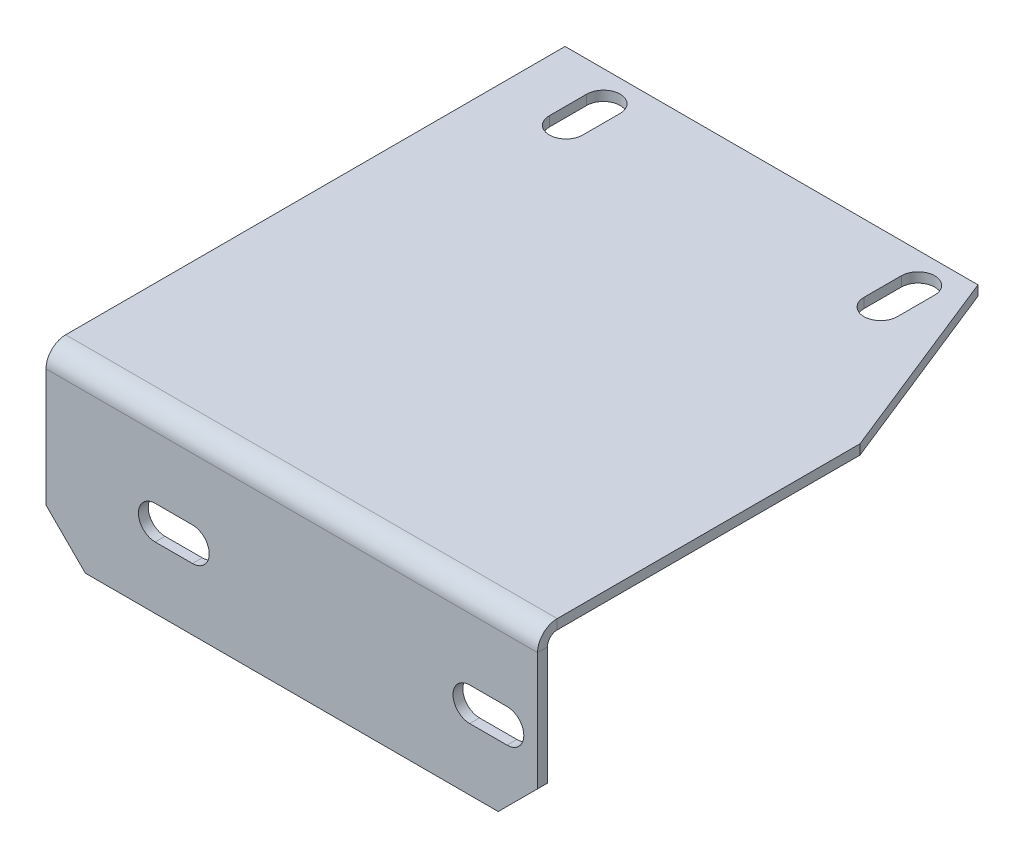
ISO-10303-21;
HEADER;
FILE_DESCRIPTION(('STEP AP214'),'2;1');
FILE_NAME('part.step','',(''),(''),'','','');
FILE_SCHEMA(('AUTOMOTIVE_DESIGN { 1 0 10303 214 1 1 1 1 }'));
ENDSEC;
DATA;
#1=APPLICATION_CONTEXT('core data for automotive mechanical design processes');
#2=APPLICATION_PROTOCOL_DEFINITION('international standard','automotive_design',2000,#1);
#3=PRODUCT_CONTEXT('',#1,'mechanical');
#4=PRODUCT('Part','Part','',(#3));
#5=PRODUCT_RELATED_PRODUCT_CATEGORY('part','',(#4));
#6=PRODUCT_DEFINITION_FORMATION('','',#4);
#7=PRODUCT_DEFINITION_CONTEXT('part definition',#1,'design');
#8=PRODUCT_DEFINITION('design','',#6,#7);
#9=PRODUCT_DEFINITION_SHAPE('','',#8);
#10=(LENGTH_UNIT() NAMED_UNIT(*) SI_UNIT(.MILLI.,.METRE.));
#11=(NAMED_UNIT(*) PLANE_ANGLE_UNIT() SI_UNIT($,.RADIAN.));
#12=(NAMED_UNIT(*) SI_UNIT($,.STERADIAN.) SOLID_ANGLE_UNIT());
#13=UNCERTAINTY_MEASURE_WITH_UNIT(LENGTH_MEASURE(1.E-05),#10,'distance_accuracy_value','');
#14=(GEOMETRIC_REPRESENTATION_CONTEXT(3) GLOBAL_UNCERTAINTY_ASSIGNED_CONTEXT((#13)) GLOBAL_UNIT_ASSIGNED_CONTEXT((#10,
#11,#12)) REPRESENTATION_CONTEXT('',''));
#15=CARTESIAN_POINT('',(0.,0.,0.));
#16=DIRECTION('',(0.,0.,1.));
#17=DIRECTION('',(1.,0.,0.));
#18=AXIS2_PLACEMENT_3D('',#15,#16,#17);
#19=CARTESIAN_POINT('',(62.5,42.4999999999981,0.));
#20=DIRECTION('',(0.,0.999999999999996,0.));
#21=DIRECTION('',(0.,0.,0.999999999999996));
#22=AXIS2_PLACEMENT_3D('',#19,#20,#21);
#23=PLANE('',#22);
#24=DIRECTION('',(0.,0.,0.999999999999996));
#25=VECTOR('',#24,1.);
#26=CARTESIAN_POINT('',(-40.75,42.4999999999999,-124.25));
#27=LINE('',#26,#25);
#28=CARTESIAN_POINT('',(-40.75,42.4999999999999,-124.25));
#29=VERTEX_POINT('',#28);
#30=CARTESIAN_POINT('',(-40.75,42.4999999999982,-114.75));
#31=VERTEX_POINT('',#30);
#32=EDGE_CURVE('E278',#29,#31,#27,.T.);
#33=ORIENTED_EDGE('',*,*,#32,.F.);
#34=CARTESIAN_POINT('',(-45.,42.5,-124.25));
#35=DIRECTION('',(0.,-0.999999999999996,0.));
#36=DIRECTION('',(0.,0.,0.999999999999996));
#37=AXIS2_PLACEMENT_3D('',#34,#35,#36);
#38=CIRCLE('',#37,4.25);
#39=CARTESIAN_POINT('',(-49.25,42.4999999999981,-124.25));
#40=VERTEX_POINT('',#39);
#41=EDGE_CURVE('E266',#40,#29,#38,.T.);
#42=ORIENTED_EDGE('',*,*,#41,.F.);
#43=DIRECTION('',(0.,0.,-0.999999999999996));
#44=VECTOR('',#43,1.);
#45=CARTESIAN_POINT('',(-49.25,42.4999999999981,-124.25));
#46=LINE('',#45,#44);
#47=CARTESIAN_POINT('',(-49.25,42.4999999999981,-114.75));
#48=VERTEX_POINT('',#47);
#49=EDGE_CURVE('E268',#48,#40,#46,.T.);
#50=ORIENTED_EDGE('',*,*,#49,.F.);
#51=CARTESIAN_POINT('',(-45.,42.5,-114.75));
#52=DIRECTION('',(0.,-0.999999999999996,0.));
#53=DIRECTION('',(0.,0.,-0.999999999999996));
#54=AXIS2_PLACEMENT_3D('',#51,#52,#53);
#55=CIRCLE('',#54,4.25);
#56=EDGE_CURVE('E287',#31,#48,#55,.T.);
#57=ORIENTED_EDGE('',*,*,#56,.F.);
#58=EDGE_LOOP('',(#33,#42,#50,#57));
#59=FACE_BOUND('',#58,.T.);
#60=DIRECTION('',(0.,0.,-0.999999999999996));
#61=VECTOR('',#60,1.);
#62=CARTESIAN_POINT('',(-1.24999999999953,42.5,0.));
#63=LINE('',#62,#61);
#64=CARTESIAN_POINT('',(-1.24999999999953,42.5,-5.));
#65=VERTEX_POINT('',#64);
#66=CARTESIAN_POINT('',(-1.25,42.4999999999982,-131.999999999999));
#67=VERTEX_POINT('',#66);
#68=EDGE_CURVE('E399',#65,#67,#63,.T.);
#69=ORIENTED_EDGE('',*,*,#68,.F.);
#70=DIRECTION('',(-1.,0.,0.));
#71=VECTOR('',#70,1.);
#72=CARTESIAN_POINT('',(62.5,42.4999999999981,-5.));
#73=LINE('',#72,#71);
#74=CARTESIAN_POINT('',(-62.5,42.5,-5.));
#75=VERTEX_POINT('',#74);
#76=EDGE_CURVE('E505',#65,#75,#73,.T.);
#77=ORIENTED_EDGE('',*,*,#76,.T.);
#78=DIRECTION('',(0.,0.,-0.999999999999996));
#79=VECTOR('',#78,1.);
#80=CARTESIAN_POINT('',(-62.4999999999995,42.5,0.));
#81=LINE('',#80,#79);
#82=CARTESIAN_POINT('',(-62.5,42.4999999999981,-132.));
#83=VERTEX_POINT('',#82);
#84=EDGE_CURVE('E457',#75,#83,#81,.T.);
#85=ORIENTED_EDGE('',*,*,#84,.T.);
#86=DIRECTION('',(-1.,0.,0.));
#87=VECTOR('',#86,1.);
#88=CARTESIAN_POINT('',(62.5,42.4999999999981,-132.));
#89=LINE('',#88,#87);
#90=EDGE_CURVE('E533',#67,#83,#89,.T.);
#91=ORIENTED_EDGE('',*,*,#90,.F.);
#92=EDGE_LOOP('',(#69,#77,#85,#91));
#93=FACE_BOUND('',#92,.T.);
#94=ADVANCED_FACE('F42',(#59,#93),#23,.F.);
#95=CARTESIAN_POINT('',(62.5,-1.88737914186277E-12,-2.5));
#96=DIRECTION('',(0.,0.,0.999999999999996));
#97=DIRECTION('',(1.,0.,0.));
#98=AXIS2_PLACEMENT_3D('',#95,#96,#97);
#99=PLANE('',#98);
#100=DIRECTION('',(1.,0.,0.));
#101=VECTOR('',#100,1.);
#102=CARTESIAN_POINT('',(-34.75,24.25,-2.5));
#103=LINE('',#102,#101);
#104=CARTESIAN_POINT('',(-34.75,24.25,-2.5));
#105=VERTEX_POINT('',#104);
#106=CARTESIAN_POINT('',(-25.25,24.25,-2.5));
#107=VERTEX_POINT('',#106);
#108=EDGE_CURVE('E417',#105,#107,#103,.T.);
#109=ORIENTED_EDGE('',*,*,#108,.F.);
#110=CARTESIAN_POINT('',(-34.75,20.,-2.5));
#111=DIRECTION('',(0.,0.,0.999999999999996));
#112=DIRECTION('',(1.,0.,0.));
#113=AXIS2_PLACEMENT_3D('',#110,#111,#112);
#114=CIRCLE('',#113,4.25);
#115=CARTESIAN_POINT('',(-34.75,15.75,-2.5));
#116=VERTEX_POINT('',#115);
#117=EDGE_CURVE('E421',#116,#105,#114,.F.);
#118=ORIENTED_EDGE('',*,*,#117,.F.);
#119=DIRECTION('',(-1.,0.,0.));
#120=VECTOR('',#119,1.);
#121=CARTESIAN_POINT('',(-34.75,15.75,-2.5));
#122=LINE('',#121,#120);
#123=CARTESIAN_POINT('',(-25.25,15.7499999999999,-2.5));
#124=VERTEX_POINT('',#123);
#125=EDGE_CURVE('E444',#124,#116,#122,.T.);
#126=ORIENTED_EDGE('',*,*,#125,.F.);
#127=CARTESIAN_POINT('',(-25.25,20.,-2.5));
#128=DIRECTION('',(0.,0.,0.999999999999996));
#129=DIRECTION('',(1.,0.,0.));
#130=AXIS2_PLACEMENT_3D('',#127,#128,#129);
#131=CIRCLE('',#130,4.25);
#132=EDGE_CURVE('E414',#107,#124,#131,.F.);
#133=ORIENTED_EDGE('',*,*,#132,.F.);
#134=EDGE_LOOP('',(#109,#118,#126,#133));
#135=FACE_BOUND('',#134,.T.);
#136=DIRECTION('',(0.,0.999999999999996,0.));
#137=VECTOR('',#136,1.);
#138=CARTESIAN_POINT('',(-1.25,0.,-2.5));
#139=LINE('',#138,#137);
#140=CARTESIAN_POINT('',(-1.25,0.,-2.5));
#141=VERTEX_POINT('',#140);
#142=CARTESIAN_POINT('',(-1.25,39.9999999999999,-2.5));
#143=VERTEX_POINT('',#142);
#144=EDGE_CURVE('E395',#141,#143,#139,.T.);
#145=ORIENTED_EDGE('',*,*,#144,.F.);
#146=DIRECTION('',(-1.,0.,0.));
#147=VECTOR('',#146,1.);
#148=CARTESIAN_POINT('',(62.5,-1.88737914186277E-12,-2.5));
#149=LINE('',#148,#147);
#150=CARTESIAN_POINT('',(-52.5,-1.88737914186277E-12,-2.49999999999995));
#151=VERTEX_POINT('',#150);
#152=EDGE_CURVE('E515',#141,#151,#149,.T.);
#153=ORIENTED_EDGE('',*,*,#152,.T.);
#154=DIRECTION('',(0.707106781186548,-0.707106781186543,0.));
#155=VECTOR('',#154,1.);
#156=CARTESIAN_POINT('',(-62.5,10.,-2.49999999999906));
#157=LINE('',#156,#155);
#158=CARTESIAN_POINT('',(-62.5,10.,-2.49999999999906));
#159=VERTEX_POINT('',#158);
#160=EDGE_CURVE('E577',#151,#159,#157,.F.);
#161=ORIENTED_EDGE('',*,*,#160,.T.);
#162=DIRECTION('',(0.,0.999999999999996,0.));
#163=VECTOR('',#162,1.);
#164=CARTESIAN_POINT('',(-62.5,0.,-2.49999999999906));
#165=LINE('',#164,#163);
#166=CARTESIAN_POINT('',(-62.5,39.9999999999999,-2.5));
#167=VERTEX_POINT('',#166);
#168=EDGE_CURVE('E477',#159,#167,#165,.T.);
#169=ORIENTED_EDGE('',*,*,#168,.T.);
#170=DIRECTION('',(-1.,0.,0.));
#171=VECTOR('',#170,1.);
#172=CARTESIAN_POINT('',(62.5000000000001,39.9999999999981,-2.49999999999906));
#173=LINE('',#172,#171);
#174=EDGE_CURVE('E510',#143,#167,#173,.T.);
#175=ORIENTED_EDGE('',*,*,#174,.F.);
#176=EDGE_LOOP('',(#145,#153,#161,#169,#175));
#177=FACE_BOUND('',#176,.T.);
#178=ADVANCED_FACE('F600',(#135,#177),#99,.F.);
#179=CARTESIAN_POINT('',(62.5,39.9999999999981,-4.99999999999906));
#180=DIRECTION('',(-1.,0.,0.));
#181=DIRECTION('',(0.,0.,0.999999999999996));
#182=AXIS2_PLACEMENT_3D('',#179,#180,#181);
#183=CYLINDRICAL_SURFACE('',#182,2.5);
#184=CARTESIAN_POINT('',(-1.25,40.,-5.));
#185=DIRECTION('',(1.,0.,0.));
#186=DIRECTION('',(0.,0.,-0.999999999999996));
#187=AXIS2_PLACEMENT_3D('',#184,#185,#186);
#188=CIRCLE('',#187,2.5);
#189=EDGE_CURVE('E580',#143,#65,#188,.F.);
#190=ORIENTED_EDGE('',*,*,#189,.F.);
#191=ORIENTED_EDGE('',*,*,#174,.T.);
#192=CARTESIAN_POINT('',(-62.5,39.9999999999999,-5.));
#193=DIRECTION('',(1.,0.,0.));
#194=DIRECTION('',(0.,0.,-0.999999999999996));
#195=AXIS2_PLACEMENT_3D('',#192,#193,#194);
#196=CIRCLE('',#195,2.5);
#197=EDGE_CURVE('E481',#167,#75,#196,.F.);
#198=ORIENTED_EDGE('',*,*,#197,.T.);
#199=ORIENTED_EDGE('',*,*,#76,.F.);
#200=EDGE_LOOP('',(#190,#191,#198,#199));
#201=FACE_BOUND('',#200,.T.);
#202=ADVANCED_FACE('F595',(#201),#183,.F.);
#203=CARTESIAN_POINT('',(62.5,44.9999999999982,-5.));
#204=DIRECTION('',(1.,0.,0.));
#205=DIRECTION('',(0.,0.,-0.999999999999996));
#206=AXIS2_PLACEMENT_3D('',#203,#204,#205);
#207=PLANE('',#206);
#208=DIRECTION('',(0.,-0.999999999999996,0.));
#209=VECTOR('',#208,1.);
#210=CARTESIAN_POINT('',(62.5,44.9999999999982,-5.));
#211=LINE('',#210,#209);
#212=CARTESIAN_POINT('',(62.5,44.9999999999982,-5.));
#213=VERTEX_POINT('',#212);
#214=CARTESIAN_POINT('',(62.5,42.4999999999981,-5.));
#215=VERTEX_POINT('',#214);
#216=EDGE_CURVE('E549',#213,#215,#211,.T.);
#217=ORIENTED_EDGE('',*,*,#216,.F.);
#218=CARTESIAN_POINT('',(62.5,39.9999999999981,-4.99999999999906));
#219=DIRECTION('',(1.,0.,0.));
#220=DIRECTION('',(0.,0.,-0.999999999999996));
#221=AXIS2_PLACEMENT_3D('',#218,#219,#220);
#222=CIRCLE('',#221,5.);
#223=CARTESIAN_POINT('',(62.5,39.9999999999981,9.43689570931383E-13));
#224=VERTEX_POINT('',#223);
#225=EDGE_CURVE('E491',#224,#213,#222,.F.);
#226=ORIENTED_EDGE('',*,*,#225,.F.);
#227=DIRECTION('',(0.,0.,0.999999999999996));
#228=VECTOR('',#227,1.);
#229=CARTESIAN_POINT('',(62.5000000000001,39.9999999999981,-2.49999999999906));
#230=LINE('',#229,#228);
#231=CARTESIAN_POINT('',(62.5000000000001,39.9999999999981,-2.49999999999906));
#232=VERTEX_POINT('',#231);
#233=EDGE_CURVE('E545',#232,#224,#230,.T.);
#234=ORIENTED_EDGE('',*,*,#233,.F.);
#235=CARTESIAN_POINT('',(62.5,39.9999999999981,-4.99999999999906));
#236=DIRECTION('',(1.,0.,0.));
#237=DIRECTION('',(0.,0.,-0.999999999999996));
#238=AXIS2_PLACEMENT_3D('',#235,#236,#237);
#239=CIRCLE('',#238,2.5);
#240=EDGE_CURVE('E501',#232,#215,#239,.F.);
#241=ORIENTED_EDGE('',*,*,#240,.T.);
#242=EDGE_LOOP('',(#217,#226,#234,#241));
#243=FACE_BOUND('',#242,.T.);
#244=ADVANCED_FACE('F44',(#243),#207,.T.);
#245=CARTESIAN_POINT('',(62.5000000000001,39.9999999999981,-2.49999999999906));
#246=DIRECTION('',(1.,0.,0.));
#247=DIRECTION('',(0.,0.,-0.999999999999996));
#248=AXIS2_PLACEMENT_3D('',#245,#246,#247);
#249=PLANE('',#248);
#250=DIRECTION('',(0.,0.,-0.999999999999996));
#251=VECTOR('',#250,1.);
#252=CARTESIAN_POINT('',(62.5,42.4999999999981,0.));
#253=LINE('',#252,#251);
#254=CARTESIAN_POINT('',(62.5,42.4999999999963,-81.9999999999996));
#255=VERTEX_POINT('',#254);
#256=EDGE_CURVE('E485',#215,#255,#253,.T.);
#257=ORIENTED_EDGE('',*,*,#256,.T.);
#258=DIRECTION('',(0.,0.999999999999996,0.));
#259=VECTOR('',#258,1.);
#260=CARTESIAN_POINT('',(62.5,39.9999999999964,-81.9999999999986));
#261=LINE('',#260,#259);
#262=CARTESIAN_POINT('',(62.5,44.9999999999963,-81.9999999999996));
#263=VERTEX_POINT('',#262);
#264=EDGE_CURVE('E51',#255,#263,#261,.T.);
#265=ORIENTED_EDGE('',*,*,#264,.T.);
#266=DIRECTION('',(0.,0.,-0.999999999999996));
#267=VECTOR('',#266,1.);
#268=CARTESIAN_POINT('',(62.5000000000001,44.9999999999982,0.));
#269=LINE('',#268,#267);
#270=EDGE_CURVE('E488',#213,#263,#269,.T.);
#271=ORIENTED_EDGE('',*,*,#270,.F.);
#272=ORIENTED_EDGE('',*,*,#216,.T.);
#273=EDGE_LOOP('',(#257,#265,#271,#272));
#274=FACE_BOUND('',#273,.T.);
#275=ADVANCED_FACE('F657',(#274),#249,.T.);
#276=CARTESIAN_POINT('',(-62.5,39.9999999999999,0.));
#277=DIRECTION('',(-1.,0.,0.));
#278=DIRECTION('',(0.,0.,0.999999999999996));
#279=AXIS2_PLACEMENT_3D('',#276,#277,#278);
#280=PLANE('',#279);
#281=DIRECTION('',(0.,0.,-0.999999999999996));
#282=VECTOR('',#281,1.);
#283=CARTESIAN_POINT('',(-62.5,39.9999999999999,0.));
#284=LINE('',#283,#282);
#285=CARTESIAN_POINT('',(-62.5,39.9999999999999,0.));
#286=VERTEX_POINT('',#285);
#287=EDGE_CURVE('E541',#286,#167,#284,.T.);
#288=ORIENTED_EDGE('',*,*,#287,.F.);
#289=CARTESIAN_POINT('',(-62.5,39.9999999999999,-5.));
#290=DIRECTION('',(1.,0.,0.));
#291=DIRECTION('',(0.,0.,-0.999999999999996));
#292=AXIS2_PLACEMENT_3D('',#289,#290,#291);
#293=CIRCLE('',#292,5.);
#294=CARTESIAN_POINT('',(-62.4999999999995,44.9999999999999,-5.));
#295=VERTEX_POINT('',#294);
#296=EDGE_CURVE('E469',#286,#295,#293,.F.);
#297=ORIENTED_EDGE('',*,*,#296,.T.);
#298=DIRECTION('',(0.,0.999999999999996,0.));
#299=VECTOR('',#298,1.);
#300=CARTESIAN_POINT('',(-62.5,42.5,-5.));
#301=LINE('',#300,#299);
#302=EDGE_CURVE('E537',#75,#295,#301,.T.);
#303=ORIENTED_EDGE('',*,*,#302,.F.);
#304=ORIENTED_EDGE('',*,*,#197,.F.);
#305=EDGE_LOOP('',(#288,#297,#303,#304));
#306=FACE_BOUND('',#305,.T.);
#307=ADVANCED_FACE('F610',(#306),#280,.T.);
#308=CARTESIAN_POINT('',(-62.5,42.5,-5.));
#309=DIRECTION('',(-1.,0.,0.));
#310=DIRECTION('',(0.,0.,0.999999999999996));
#311=AXIS2_PLACEMENT_3D('',#308,#309,#310);
#312=PLANE('',#311);
#313=ORIENTED_EDGE('',*,*,#168,.F.);
#314=DIRECTION('',(0.,0.,0.999999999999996));
#315=VECTOR('',#314,1.);
#316=CARTESIAN_POINT('',(-62.4999999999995,10.,-4.99999999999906));
#317=LINE('',#316,#315);
#318=CARTESIAN_POINT('',(-62.4999999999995,10.,9.43689570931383E-13));
#319=VERTEX_POINT('',#318);
#320=EDGE_CURVE('E565',#159,#319,#317,.T.);
#321=ORIENTED_EDGE('',*,*,#320,.T.);
#322=DIRECTION('',(0.,0.999999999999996,0.));
#323=VECTOR('',#322,1.);
#324=CARTESIAN_POINT('',(-62.4999999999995,0.,9.43689570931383E-13));
#325=LINE('',#324,#323);
#326=EDGE_CURVE('E473',#319,#286,#325,.T.);
#327=ORIENTED_EDGE('',*,*,#326,.T.);
#328=ORIENTED_EDGE('',*,*,#287,.T.);
#329=EDGE_LOOP('',(#313,#321,#327,#328));
#330=FACE_BOUND('',#329,.T.);
#331=ADVANCED_FACE('F605',(#330),#312,.T.);
#332=DIRECTION('',(0.,0.,0.999999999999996));
#333=VECTOR('',#332,1.);
#334=CARTESIAN_POINT('',(39.25,42.4999999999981,-124.249999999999));
#335=LINE('',#334,#333);
#336=CARTESIAN_POINT('',(39.25,42.4999999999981,-124.249999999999));
#337=VERTEX_POINT('',#336);
#338=CARTESIAN_POINT('',(39.25,42.4999999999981,-114.749999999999));
#339=VERTEX_POINT('',#338);
#340=EDGE_CURVE('E358',#337,#339,#335,.T.);
#341=ORIENTED_EDGE('',*,*,#340,.F.);
#342=CARTESIAN_POINT('',(35.,42.4999999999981,-124.25));
#343=DIRECTION('',(0.,-0.999999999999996,0.));
#344=DIRECTION('',(0.,0.,0.999999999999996));
#345=AXIS2_PLACEMENT_3D('',#342,#343,#344);
#346=CIRCLE('',#345,4.25);
#347=CARTESIAN_POINT('',(30.75,42.4999999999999,-124.25));
#348=VERTEX_POINT('',#347);
#349=EDGE_CURVE('E355',#348,#337,#346,.T.);
#350=ORIENTED_EDGE('',*,*,#349,.F.);
#351=DIRECTION('',(0.,0.,-0.999999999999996));
#352=VECTOR('',#351,1.);
#353=CARTESIAN_POINT('',(30.75,42.4999999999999,-124.25));
#354=LINE('',#353,#352);
#355=CARTESIAN_POINT('',(30.75,42.4999999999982,-114.75));
#356=VERTEX_POINT('',#355);
#357=EDGE_CURVE('E366',#356,#348,#354,.T.);
#358=ORIENTED_EDGE('',*,*,#357,.F.);
#359=CARTESIAN_POINT('',(35.,42.4999999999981,-114.75));
#360=DIRECTION('',(0.,-0.999999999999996,0.));
#361=DIRECTION('',(0.,0.,-0.999999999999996));
#362=AXIS2_PLACEMENT_3D('',#359,#360,#361);
#363=CIRCLE('',#362,4.25);
#364=EDGE_CURVE('E362',#339,#356,#363,.T.);
#365=ORIENTED_EDGE('',*,*,#364,.F.);
#366=EDGE_LOOP('',(#341,#350,#358,#365));
#367=FACE_BOUND('',#366,.T.);
#368=CARTESIAN_POINT('',(42.5,42.4999999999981,-132.));
#369=VERTEX_POINT('',#368);
#370=CARTESIAN_POINT('',(1.25,42.4999999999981,-131.999999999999));
#371=VERTEX_POINT('',#370);
#372=EDGE_CURVE('E534',#369,#371,#89,.T.);
#373=ORIENTED_EDGE('',*,*,#372,.F.);
#374=DIRECTION('',(-0.371390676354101,0.,-0.928476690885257));
#375=VECTOR('',#374,1.);
#376=CARTESIAN_POINT('',(42.5,42.4999999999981,-132.));
#377=LINE('',#376,#375);
#378=EDGE_CURVE('E65',#369,#255,#377,.F.);
#379=ORIENTED_EDGE('',*,*,#378,.T.);
#380=ORIENTED_EDGE('',*,*,#256,.F.);
#381=CARTESIAN_POINT('',(1.25000000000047,42.5,-5.));
#382=VERTEX_POINT('',#381);
#383=EDGE_CURVE('E506',#215,#382,#73,.T.);
#384=ORIENTED_EDGE('',*,*,#383,.T.);
#385=DIRECTION('',(0.,0.,-0.999999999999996));
#386=VECTOR('',#385,1.);
#387=CARTESIAN_POINT('',(1.25000000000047,42.5,0.));
#388=LINE('',#387,#386);
#389=EDGE_CURVE('E406',#382,#371,#388,.T.);
#390=ORIENTED_EDGE('',*,*,#389,.T.);
#391=EDGE_LOOP('',(#373,#379,#380,#384,#390));
#392=FACE_BOUND('',#391,.T.);
#393=ADVANCED_FACE('F660',(#367,#392),#23,.F.);
#394=CARTESIAN_POINT('',(62.5,44.999999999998,-132.));
#395=DIRECTION('',(0.,0.,-0.999999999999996));
#396=DIRECTION('',(-1.,0.,0.));
#397=AXIS2_PLACEMENT_3D('',#394,#395,#396);
#398=PLANE('',#397);
#399=DIRECTION('',(-1.,0.,0.));
#400=VECTOR('',#399,1.);
#401=CARTESIAN_POINT('',(62.5,44.999999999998,-132.));
#402=LINE('',#401,#400);
#403=CARTESIAN_POINT('',(42.5,44.9999999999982,-132.));
#404=VERTEX_POINT('',#403);
#405=CARTESIAN_POINT('',(-62.4999999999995,44.9999999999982,-132.));
#406=VERTEX_POINT('',#405);
#407=EDGE_CURVE('E530',#404,#406,#402,.T.);
#408=ORIENTED_EDGE('',*,*,#407,.F.);
#409=DIRECTION('',(0.,-0.999999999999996,0.));
#410=VECTOR('',#409,1.);
#411=CARTESIAN_POINT('',(42.5,44.9999999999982,-132.));
#412=LINE('',#411,#410);
#413=EDGE_CURVE('E587',#404,#369,#412,.T.);
#414=ORIENTED_EDGE('',*,*,#413,.T.);
#415=ORIENTED_EDGE('',*,*,#372,.T.);
#416=DIRECTION('',(1.,0.,0.));
#417=VECTOR('',#416,1.);
#418=CARTESIAN_POINT('',(62.5,42.4999999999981,-132.));
#419=LINE('',#418,#417);
#420=EDGE_CURVE('E410',#371,#67,#419,.F.);
#421=ORIENTED_EDGE('',*,*,#420,.T.);
#422=ORIENTED_EDGE('',*,*,#90,.T.);
#423=DIRECTION('',(0.,-0.999999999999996,0.));
#424=VECTOR('',#423,1.);
#425=CARTESIAN_POINT('',(-62.4999999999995,44.9999999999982,-132.));
#426=LINE('',#425,#424);
#427=EDGE_CURVE('E461',#406,#83,#426,.T.);
#428=ORIENTED_EDGE('',*,*,#427,.F.);
#429=EDGE_LOOP('',(#408,#414,#415,#421,#422,#428));
#430=FACE_BOUND('',#429,.T.);
#431=ADVANCED_FACE('F621',(#430),#398,.T.);
#432=CARTESIAN_POINT('',(62.5000000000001,44.9999999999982,0.));
#433=DIRECTION('',(0.,0.999999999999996,0.));
#434=DIRECTION('',(0.,0.,0.999999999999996));
#435=AXIS2_PLACEMENT_3D('',#432,#433,#434);
#436=PLANE('',#435);
#437=CARTESIAN_POINT('',(-45.,44.9999999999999,-124.25));
#438=DIRECTION('',(0.,0.999999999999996,0.));
#439=DIRECTION('',(0.,0.,0.999999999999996));
#440=AXIS2_PLACEMENT_3D('',#437,#438,#439);
#441=CIRCLE('',#440,4.25);
#442=CARTESIAN_POINT('',(-49.25,44.999999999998,-124.25));
#443=VERTEX_POINT('',#442);
#444=CARTESIAN_POINT('',(-40.75,44.9999999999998,-124.25));
#445=VERTEX_POINT('',#444);
#446=EDGE_CURVE('E263',#443,#445,#441,.F.);
#447=ORIENTED_EDGE('',*,*,#446,.T.);
#448=DIRECTION('',(0.,0.,0.999999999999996));
#449=VECTOR('',#448,1.);
#450=CARTESIAN_POINT('',(-40.75,44.9999999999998,-124.25));
#451=LINE('',#450,#449);
#452=CARTESIAN_POINT('',(-40.7499999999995,44.9999999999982,-114.75));
#453=VERTEX_POINT('',#452);
#454=EDGE_CURVE('E246',#445,#453,#451,.T.);
#455=ORIENTED_EDGE('',*,*,#454,.T.);
#456=CARTESIAN_POINT('',(-44.9999999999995,44.9999999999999,-114.75));
#457=DIRECTION('',(0.,0.999999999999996,0.));
#458=DIRECTION('',(0.,0.,0.999999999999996));
#459=AXIS2_PLACEMENT_3D('',#456,#457,#458);
#460=CIRCLE('',#459,4.25);
#461=CARTESIAN_POINT('',(-49.2499999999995,44.999999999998,-114.75));
#462=VERTEX_POINT('',#461);
#463=EDGE_CURVE('E281',#453,#462,#460,.F.);
#464=ORIENTED_EDGE('',*,*,#463,.T.);
#465=DIRECTION('',(0.,0.,-0.999999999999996));
#466=VECTOR('',#465,1.);
#467=CARTESIAN_POINT('',(-49.25,44.999999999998,-124.25));
#468=LINE('',#467,#466);
#469=EDGE_CURVE('E273',#462,#443,#468,.T.);
#470=ORIENTED_EDGE('',*,*,#469,.T.);
#471=EDGE_LOOP('',(#447,#455,#464,#470));
#472=FACE_BOUND('',#471,.T.);
#473=CARTESIAN_POINT('',(35.,44.9999999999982,-124.25));
#474=DIRECTION('',(0.,0.999999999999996,0.));
#475=DIRECTION('',(0.,0.,0.999999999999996));
#476=AXIS2_PLACEMENT_3D('',#473,#474,#475);
#477=CIRCLE('',#476,4.25);
#478=CARTESIAN_POINT('',(30.75,44.9999999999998,-124.25));
#479=VERTEX_POINT('',#478);
#480=CARTESIAN_POINT('',(39.25,44.9999999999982,-124.25));
#481=VERTEX_POINT('',#480);
#482=EDGE_CURVE('E351',#479,#481,#477,.F.);
#483=ORIENTED_EDGE('',*,*,#482,.T.);
#484=DIRECTION('',(0.,0.,0.999999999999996));
#485=VECTOR('',#484,1.);
#486=CARTESIAN_POINT('',(39.25,44.9999999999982,-124.25));
#487=LINE('',#486,#485);
#488=CARTESIAN_POINT('',(39.25,44.9999999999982,-114.75));
#489=VERTEX_POINT('',#488);
#490=EDGE_CURVE('E374',#481,#489,#487,.T.);
#491=ORIENTED_EDGE('',*,*,#490,.T.);
#492=CARTESIAN_POINT('',(35.,44.9999999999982,-114.75));
#493=DIRECTION('',(0.,0.999999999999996,0.));
#494=DIRECTION('',(0.,0.,0.999999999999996));
#495=AXIS2_PLACEMENT_3D('',#492,#493,#494);
#496=CIRCLE('',#495,4.25);
#497=CARTESIAN_POINT('',(30.75,44.9999999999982,-114.75));
#498=VERTEX_POINT('',#497);
#499=EDGE_CURVE('E343',#489,#498,#496,.F.);
#500=ORIENTED_EDGE('',*,*,#499,.T.);
#501=DIRECTION('',(0.,0.,-0.999999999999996));
#502=VECTOR('',#501,1.);
#503=CARTESIAN_POINT('',(30.75,44.9999999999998,-124.25));
#504=LINE('',#503,#502);
#505=EDGE_CURVE('E347',#498,#479,#504,.T.);
#506=ORIENTED_EDGE('',*,*,#505,.T.);
#507=EDGE_LOOP('',(#483,#491,#500,#506));
#508=FACE_BOUND('',#507,.T.);
#509=ORIENTED_EDGE('',*,*,#270,.T.);
#510=DIRECTION('',(0.371390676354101,0.,0.928476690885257));
#511=VECTOR('',#510,1.);
#512=CARTESIAN_POINT('',(90.7758620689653,44.9999999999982,-11.310344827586));
#513=LINE('',#512,#511);
#514=EDGE_CURVE('E11',#263,#404,#513,.F.);
#515=ORIENTED_EDGE('',*,*,#514,.T.);
#516=ORIENTED_EDGE('',*,*,#407,.T.);
#517=DIRECTION('',(0.,0.,-0.999999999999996));
#518=VECTOR('',#517,1.);
#519=CARTESIAN_POINT('',(-62.4999999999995,44.9999999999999,0.));
#520=LINE('',#519,#518);
#521=EDGE_CURVE('E465',#295,#406,#520,.T.);
#522=ORIENTED_EDGE('',*,*,#521,.F.);
#523=DIRECTION('',(-1.,0.,0.));
#524=VECTOR('',#523,1.);
#525=CARTESIAN_POINT('',(62.5,44.9999999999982,-5.));
#526=LINE('',#525,#524);
#527=EDGE_CURVE('E527',#213,#295,#526,.T.);
#528=ORIENTED_EDGE('',*,*,#527,.F.);
#529=EDGE_LOOP('',(#509,#515,#516,#522,#528));
#530=FACE_BOUND('',#529,.T.);
#531=ADVANCED_FACE('F271',(#472,#508,#530),#436,.T.);
#532=CARTESIAN_POINT('',(62.5,39.9999999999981,-4.99999999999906));
#533=DIRECTION('',(-1.,0.,0.));
#534=DIRECTION('',(0.,0.,0.999999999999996));
#535=AXIS2_PLACEMENT_3D('',#532,#533,#534);
#536=CYLINDRICAL_SURFACE('',#535,5.);
#537=ORIENTED_EDGE('',*,*,#527,.T.);
#538=ORIENTED_EDGE('',*,*,#296,.F.);
#539=DIRECTION('',(-1.,0.,0.));
#540=VECTOR('',#539,1.);
#541=CARTESIAN_POINT('',(62.5,39.9999999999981,9.43689570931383E-13));
#542=LINE('',#541,#540);
#543=EDGE_CURVE('E524',#224,#286,#542,.T.);
#544=ORIENTED_EDGE('',*,*,#543,.F.);
#545=ORIENTED_EDGE('',*,*,#225,.T.);
#546=EDGE_LOOP('',(#537,#538,#544,#545));
#547=FACE_BOUND('',#546,.T.);
#548=ADVANCED_FACE('F651',(#547),#536,.T.);
#549=CARTESIAN_POINT('',(62.5,-1.88737914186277E-12,0.));
#550=DIRECTION('',(0.,0.,0.999999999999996));
#551=DIRECTION('',(1.,0.,0.));
#552=AXIS2_PLACEMENT_3D('',#549,#550,#551);
#553=PLANE('',#552);
#554=CARTESIAN_POINT('',(45.25,20.,0.));
#555=DIRECTION('',(0.,0.,0.999999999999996));
#556=DIRECTION('',(-1.,0.,0.));
#557=AXIS2_PLACEMENT_3D('',#554,#555,#556);
#558=CIRCLE('',#557,4.25);
#559=CARTESIAN_POINT('',(45.25,24.25,0.));
#560=VERTEX_POINT('',#559);
#561=CARTESIAN_POINT('',(45.25,15.7499999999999,0.));
#562=VERTEX_POINT('',#561);
#563=EDGE_CURVE('E311',#560,#562,#558,.T.);
#564=ORIENTED_EDGE('',*,*,#563,.F.);
#565=DIRECTION('',(-1.,0.,0.));
#566=VECTOR('',#565,1.);
#567=CARTESIAN_POINT('',(45.25,24.25,0.));
#568=LINE('',#567,#566);
#569=CARTESIAN_POINT('',(54.75,24.2499999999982,0.));
#570=VERTEX_POINT('',#569);
#571=EDGE_CURVE('E322',#570,#560,#568,.T.);
#572=ORIENTED_EDGE('',*,*,#571,.F.);
#573=CARTESIAN_POINT('',(54.75,19.9999999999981,0.));
#574=DIRECTION('',(0.,0.,0.999999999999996));
#575=DIRECTION('',(1.,0.,0.));
#576=AXIS2_PLACEMENT_3D('',#573,#574,#575);
#577=CIRCLE('',#576,4.25);
#578=CARTESIAN_POINT('',(54.75,15.7499999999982,0.));
#579=VERTEX_POINT('',#578);
#580=EDGE_CURVE('E318',#579,#570,#577,.T.);
#581=ORIENTED_EDGE('',*,*,#580,.F.);
#582=DIRECTION('',(1.,0.,0.));
#583=VECTOR('',#582,1.);
#584=CARTESIAN_POINT('',(45.25,15.7499999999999,0.));
#585=LINE('',#584,#583);
#586=EDGE_CURVE('E314',#562,#579,#585,.T.);
#587=ORIENTED_EDGE('',*,*,#586,.F.);
#588=EDGE_LOOP('',(#564,#572,#581,#587));
#589=FACE_BOUND('',#588,.T.);
#590=ORIENTED_EDGE('',*,*,#543,.T.);
#591=ORIENTED_EDGE('',*,*,#326,.F.);
#592=DIRECTION('',(-0.707106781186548,0.707106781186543,0.));
#593=VECTOR('',#592,1.);
#594=CARTESIAN_POINT('',(5.00000000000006,-57.5,0.));
#595=LINE('',#594,#593);
#596=CARTESIAN_POINT('',(-52.4999999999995,-1.88737914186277E-12,0.));
#597=VERTEX_POINT('',#596);
#598=EDGE_CURVE('E569',#319,#597,#595,.F.);
#599=ORIENTED_EDGE('',*,*,#598,.T.);
#600=DIRECTION('',(-1.,0.,0.));
#601=VECTOR('',#600,1.);
#602=CARTESIAN_POINT('',(62.5,-1.88737914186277E-12,0.));
#603=LINE('',#602,#601);
#604=CARTESIAN_POINT('',(52.5,0.,9.43689570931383E-13));
#605=VERTEX_POINT('',#604);
#606=EDGE_CURVE('E520',#605,#597,#603,.T.);
#607=ORIENTED_EDGE('',*,*,#606,.F.);
#608=DIRECTION('',(-0.707106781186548,-0.707106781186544,0.));
#609=VECTOR('',#608,1.);
#610=CARTESIAN_POINT('',(57.5,4.99999999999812,0.));
#611=LINE('',#610,#609);
#612=CARTESIAN_POINT('',(62.5000000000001,9.99999999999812,0.));
#613=VERTEX_POINT('',#612);
#614=EDGE_CURVE('E556',#605,#613,#611,.F.);
#615=ORIENTED_EDGE('',*,*,#614,.T.);
#616=DIRECTION('',(0.,0.999999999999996,0.));
#617=VECTOR('',#616,1.);
#618=CARTESIAN_POINT('',(62.5,-1.88737914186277E-12,0.));
#619=LINE('',#618,#617);
#620=EDGE_CURVE('E495',#613,#224,#619,.T.);
#621=ORIENTED_EDGE('',*,*,#620,.T.);
#622=EDGE_LOOP('',(#590,#591,#599,#607,#615,#621));
#623=FACE_BOUND('',#622,.T.);
#624=CARTESIAN_POINT('',(-34.75,20.,0.));
#625=DIRECTION('',(0.,0.,0.999999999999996));
#626=DIRECTION('',(-1.,0.,0.));
#627=AXIS2_PLACEMENT_3D('',#624,#625,#626);
#628=CIRCLE('',#627,4.25);
#629=CARTESIAN_POINT('',(-34.7499999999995,24.25,0.));
#630=VERTEX_POINT('',#629);
#631=CARTESIAN_POINT('',(-34.7499999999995,15.75,0.));
#632=VERTEX_POINT('',#631);
#633=EDGE_CURVE('E425',#630,#632,#628,.T.);
#634=ORIENTED_EDGE('',*,*,#633,.F.);
#635=DIRECTION('',(-1.,0.,0.));
#636=VECTOR('',#635,1.);
#637=CARTESIAN_POINT('',(-34.7499999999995,24.25,0.));
#638=LINE('',#637,#636);
#639=CARTESIAN_POINT('',(-25.2499999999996,24.25,0.));
#640=VERTEX_POINT('',#639);
#641=EDGE_CURVE('E436',#640,#630,#638,.T.);
#642=ORIENTED_EDGE('',*,*,#641,.F.);
#643=CARTESIAN_POINT('',(-25.25,20.,0.));
#644=DIRECTION('',(0.,0.,0.999999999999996));
#645=DIRECTION('',(1.,0.,0.));
#646=AXIS2_PLACEMENT_3D('',#643,#644,#645);
#647=CIRCLE('',#646,4.25);
#648=CARTESIAN_POINT('',(-25.2499999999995,15.7499999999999,0.));
#649=VERTEX_POINT('',#648);
#650=EDGE_CURVE('E432',#649,#640,#647,.T.);
#651=ORIENTED_EDGE('',*,*,#650,.F.);
#652=DIRECTION('',(1.,0.,0.));
#653=VECTOR('',#652,1.);
#654=CARTESIAN_POINT('',(-34.7499999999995,15.75,0.));
#655=LINE('',#654,#653);
#656=EDGE_CURVE('E428',#632,#649,#655,.T.);
#657=ORIENTED_EDGE('',*,*,#656,.F.);
#658=EDGE_LOOP('',(#634,#642,#651,#657));
#659=FACE_BOUND('',#658,.T.);
#660=ADVANCED_FACE('F645',(#589,#623,#659),#553,.T.);
#661=CARTESIAN_POINT('',(62.5,-1.88737914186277E-12,-2.5));
#662=DIRECTION('',(0.,-0.999999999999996,0.));
#663=DIRECTION('',(0.,0.,-0.999999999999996));
#664=AXIS2_PLACEMENT_3D('',#661,#662,#663);
#665=PLANE('',#664);
#666=ORIENTED_EDGE('',*,*,#606,.T.);
#667=DIRECTION('',(0.,0.,-0.999999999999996));
#668=VECTOR('',#667,1.);
#669=CARTESIAN_POINT('',(-52.5,-1.88737914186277E-12,-2.49999999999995));
#670=LINE('',#669,#668);
#671=EDGE_CURVE('E573',#597,#151,#670,.T.);
#672=ORIENTED_EDGE('',*,*,#671,.T.);
#673=ORIENTED_EDGE('',*,*,#152,.F.);
#674=CARTESIAN_POINT('',(1.25,0.,-2.5));
#675=VERTEX_POINT('',#674);
#676=EDGE_CURVE('E521',#675,#141,#149,.T.);
#677=ORIENTED_EDGE('',*,*,#676,.F.);
#678=CARTESIAN_POINT('',(52.5,0.,-2.49999999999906));
#679=VERTEX_POINT('',#678);
#680=EDGE_CURVE('E516',#679,#675,#149,.T.);
#681=ORIENTED_EDGE('',*,*,#680,.F.);
#682=DIRECTION('',(0.,0.,0.999999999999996));
#683=VECTOR('',#682,1.);
#684=CARTESIAN_POINT('',(52.5,0.,-2.49999999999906));
#685=LINE('',#684,#683);
#686=EDGE_CURVE('E552',#679,#605,#685,.T.);
#687=ORIENTED_EDGE('',*,*,#686,.T.);
#688=EDGE_LOOP('',(#666,#672,#673,#677,#681,#687));
#689=FACE_BOUND('',#688,.T.);
#690=ADVANCED_FACE('F639',(#689),#665,.T.);
#691=DIRECTION('',(1.,0.,0.));
#692=VECTOR('',#691,1.);
#693=CARTESIAN_POINT('',(45.25,24.25,-2.5));
#694=LINE('',#693,#692);
#695=CARTESIAN_POINT('',(45.25,24.25,-2.5));
#696=VERTEX_POINT('',#695);
#697=CARTESIAN_POINT('',(54.7500000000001,24.2499999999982,-2.5));
#698=VERTEX_POINT('',#697);
#699=EDGE_CURVE('E303',#696,#698,#694,.T.);
#700=ORIENTED_EDGE('',*,*,#699,.F.);
#701=CARTESIAN_POINT('',(45.25,20.,-2.5));
#702=DIRECTION('',(0.,0.,0.999999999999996));
#703=DIRECTION('',(1.,0.,0.));
#704=AXIS2_PLACEMENT_3D('',#701,#702,#703);
#705=CIRCLE('',#704,4.25);
#706=CARTESIAN_POINT('',(45.25,15.7499999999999,-2.5));
#707=VERTEX_POINT('',#706);
#708=EDGE_CURVE('E307',#707,#696,#705,.F.);
#709=ORIENTED_EDGE('',*,*,#708,.F.);
#710=DIRECTION('',(-1.,0.,0.));
#711=VECTOR('',#710,1.);
#712=CARTESIAN_POINT('',(45.25,15.7499999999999,-2.5));
#713=LINE('',#712,#711);
#714=CARTESIAN_POINT('',(54.75,15.7499999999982,-2.5));
#715=VERTEX_POINT('',#714);
#716=EDGE_CURVE('E330',#715,#707,#713,.T.);
#717=ORIENTED_EDGE('',*,*,#716,.F.);
#718=CARTESIAN_POINT('',(54.75,19.9999999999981,-2.5));
#719=DIRECTION('',(0.,0.,0.999999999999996));
#720=DIRECTION('',(1.,0.,0.));
#721=AXIS2_PLACEMENT_3D('',#718,#719,#720);
#722=CIRCLE('',#721,4.25);
#723=EDGE_CURVE('E258',#698,#715,#722,.F.);
#724=ORIENTED_EDGE('',*,*,#723,.F.);
#725=EDGE_LOOP('',(#700,#709,#717,#724));
#726=FACE_BOUND('',#725,.T.);
#727=ORIENTED_EDGE('',*,*,#680,.T.);
#728=DIRECTION('',(0.,0.999999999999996,0.));
#729=VECTOR('',#728,1.);
#730=CARTESIAN_POINT('',(1.25,0.,-2.5));
#731=LINE('',#730,#729);
#732=CARTESIAN_POINT('',(1.25,39.9999999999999,-2.5));
#733=VERTEX_POINT('',#732);
#734=EDGE_CURVE('E403',#675,#733,#731,.T.);
#735=ORIENTED_EDGE('',*,*,#734,.T.);
#736=EDGE_CURVE('E511',#232,#733,#173,.T.);
#737=ORIENTED_EDGE('',*,*,#736,.F.);
#738=DIRECTION('',(0.,0.999999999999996,0.));
#739=VECTOR('',#738,1.);
#740=CARTESIAN_POINT('',(62.5,-1.88737914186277E-12,-2.5));
#741=LINE('',#740,#739);
#742=CARTESIAN_POINT('',(62.5000000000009,9.99999999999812,-2.49999999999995));
#743=VERTEX_POINT('',#742);
#744=EDGE_CURVE('E498',#743,#232,#741,.T.);
#745=ORIENTED_EDGE('',*,*,#744,.F.);
#746=DIRECTION('',(0.707106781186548,0.707106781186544,0.));
#747=VECTOR('',#746,1.);
#748=CARTESIAN_POINT('',(52.5,0.,-2.49999999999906));
#749=LINE('',#748,#747);
#750=EDGE_CURVE('E562',#743,#679,#749,.F.);
#751=ORIENTED_EDGE('',*,*,#750,.T.);
#752=EDGE_LOOP('',(#727,#735,#737,#745,#751));
#753=FACE_BOUND('',#752,.T.);
#754=ADVANCED_FACE('F667',(#726,#753),#99,.F.);
#755=ORIENTED_EDGE('',*,*,#736,.T.);
#756=CARTESIAN_POINT('',(1.25,39.9999999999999,-5.));
#757=DIRECTION('',(1.,0.,0.));
#758=DIRECTION('',(0.,0.,-0.999999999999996));
#759=AXIS2_PLACEMENT_3D('',#756,#757,#758);
#760=CIRCLE('',#759,2.5);
#761=EDGE_CURVE('E584',#733,#382,#760,.F.);
#762=ORIENTED_EDGE('',*,*,#761,.T.);
#763=ORIENTED_EDGE('',*,*,#383,.F.);
#764=ORIENTED_EDGE('',*,*,#240,.F.);
#765=EDGE_LOOP('',(#755,#762,#763,#764));
#766=FACE_BOUND('',#765,.T.);
#767=ADVANCED_FACE('F670',(#766),#183,.F.);
#768=CARTESIAN_POINT('',(62.5,39.9999999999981,-4.99999999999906));
#769=DIRECTION('',(1.,0.,0.));
#770=DIRECTION('',(0.,0.,-0.999999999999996));
#771=AXIS2_PLACEMENT_3D('',#768,#769,#770);
#772=PLANE('',#771);
#773=ORIENTED_EDGE('',*,*,#620,.F.);
#774=DIRECTION('',(0.,0.,-0.999999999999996));
#775=VECTOR('',#774,1.);
#776=CARTESIAN_POINT('',(62.5,9.99999999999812,-4.99999999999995));
#777=LINE('',#776,#775);
#778=EDGE_CURVE('E559',#613,#743,#777,.T.);
#779=ORIENTED_EDGE('',*,*,#778,.T.);
#780=ORIENTED_EDGE('',*,*,#744,.T.);
#781=ORIENTED_EDGE('',*,*,#233,.T.);
#782=EDGE_LOOP('',(#773,#779,#780,#781));
#783=FACE_BOUND('',#782,.T.);
#784=ADVANCED_FACE('F672',(#783),#772,.T.);
#785=CARTESIAN_POINT('',(-62.5,39.9999999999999,-5.));
#786=DIRECTION('',(1.,0.,0.));
#787=DIRECTION('',(0.,0.,-0.999999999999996));
#788=AXIS2_PLACEMENT_3D('',#785,#786,#787);
#789=PLANE('',#788);
#790=ORIENTED_EDGE('',*,*,#84,.F.);
#791=ORIENTED_EDGE('',*,*,#302,.T.);
#792=ORIENTED_EDGE('',*,*,#521,.T.);
#793=ORIENTED_EDGE('',*,*,#427,.T.);
#794=EDGE_LOOP('',(#790,#791,#792,#793));
#795=FACE_BOUND('',#794,.T.);
#796=ADVANCED_FACE('F613',(#795),#789,.F.);
#797=CARTESIAN_POINT('',(-34.75,19.9999999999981,-132.001));
#798=DIRECTION('',(0.,0.,0.999999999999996));
#799=DIRECTION('',(1.,0.,0.));
#800=AXIS2_PLACEMENT_3D('',#797,#798,#799);
#801=CYLINDRICAL_SURFACE('',#800,4.25);
#802=ORIENTED_EDGE('',*,*,#117,.T.);
#803=DIRECTION('',(0.,0.,0.999999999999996));
#804=VECTOR('',#803,1.);
#805=CARTESIAN_POINT('',(-34.75,24.2499999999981,-132.001));
#806=LINE('',#805,#804);
#807=EDGE_CURVE('E441',#105,#630,#806,.T.);
#808=ORIENTED_EDGE('',*,*,#807,.T.);
#809=ORIENTED_EDGE('',*,*,#633,.T.);
#810=DIRECTION('',(0.,0.,0.999999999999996));
#811=VECTOR('',#810,1.);
#812=CARTESIAN_POINT('',(-34.75,15.7499999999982,-132.001));
#813=LINE('',#812,#811);
#814=EDGE_CURVE('E440',#116,#632,#813,.T.);
#815=ORIENTED_EDGE('',*,*,#814,.F.);
#816=EDGE_LOOP('',(#802,#808,#809,#815));
#817=FACE_BOUND('',#816,.T.);
#818=ADVANCED_FACE('F744',(#817),#801,.F.);
#819=CARTESIAN_POINT('',(-34.75,24.2499999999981,-132.001));
#820=DIRECTION('',(0.,0.999999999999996,0.));
#821=DIRECTION('',(0.,0.,0.999999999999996));
#822=AXIS2_PLACEMENT_3D('',#819,#820,#821);
#823=PLANE('',#822);
#824=ORIENTED_EDGE('',*,*,#108,.T.);
#825=DIRECTION('',(0.,0.,0.999999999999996));
#826=VECTOR('',#825,1.);
#827=CARTESIAN_POINT('',(-25.25,24.2499999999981,-132.001));
#828=LINE('',#827,#826);
#829=EDGE_CURVE('E445',#107,#640,#828,.T.);
#830=ORIENTED_EDGE('',*,*,#829,.T.);
#831=ORIENTED_EDGE('',*,*,#641,.T.);
#832=ORIENTED_EDGE('',*,*,#807,.F.);
#833=EDGE_LOOP('',(#824,#830,#831,#832));
#834=FACE_BOUND('',#833,.T.);
#835=ADVANCED_FACE('F740',(#834),#823,.F.);
#836=CARTESIAN_POINT('',(-25.25,19.9999999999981,-132.001));
#837=DIRECTION('',(0.,0.,0.999999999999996));
#838=DIRECTION('',(1.,0.,0.));
#839=AXIS2_PLACEMENT_3D('',#836,#837,#838);
#840=CYLINDRICAL_SURFACE('',#839,4.25);
#841=ORIENTED_EDGE('',*,*,#132,.T.);
#842=DIRECTION('',(0.,0.,0.999999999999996));
#843=VECTOR('',#842,1.);
#844=CARTESIAN_POINT('',(-25.25,15.7499999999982,-132.001));
#845=LINE('',#844,#843);
#846=EDGE_CURVE('E448',#124,#649,#845,.T.);
#847=ORIENTED_EDGE('',*,*,#846,.T.);
#848=ORIENTED_EDGE('',*,*,#650,.T.);
#849=ORIENTED_EDGE('',*,*,#829,.F.);
#850=EDGE_LOOP('',(#841,#847,#848,#849));
#851=FACE_BOUND('',#850,.T.);
#852=ADVANCED_FACE('F743',(#851),#840,.F.);
#853=CARTESIAN_POINT('',(-34.75,15.7499999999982,-132.001));
#854=DIRECTION('',(0.,-0.999999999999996,0.));
#855=DIRECTION('',(0.,0.,-0.999999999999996));
#856=AXIS2_PLACEMENT_3D('',#853,#854,#855);
#857=PLANE('',#856);
#858=ORIENTED_EDGE('',*,*,#125,.T.);
#859=ORIENTED_EDGE('',*,*,#814,.T.);
#860=ORIENTED_EDGE('',*,*,#656,.T.);
#861=ORIENTED_EDGE('',*,*,#846,.F.);
#862=EDGE_LOOP('',(#858,#859,#860,#861));
#863=FACE_BOUND('',#862,.T.);
#864=ADVANCED_FACE('F738',(#863),#857,.F.);
#865=CARTESIAN_POINT('',(52.5,0.,-2.49999999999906));
#866=DIRECTION('',(-0.707106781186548,0.707106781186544,0.));
#867=DIRECTION('',(-0.707106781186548,-0.707106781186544,0.));
#868=AXIS2_PLACEMENT_3D('',#865,#866,#867);
#869=PLANE('',#868);
#870=ORIENTED_EDGE('',*,*,#750,.F.);
#871=ORIENTED_EDGE('',*,*,#778,.F.);
#872=ORIENTED_EDGE('',*,*,#614,.F.);
#873=ORIENTED_EDGE('',*,*,#686,.F.);
#874=EDGE_LOOP('',(#870,#871,#872,#873));
#875=FACE_BOUND('',#874,.T.);
#876=ADVANCED_FACE('F735',(#875),#869,.F.);
#877=CARTESIAN_POINT('',(-62.4999999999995,10.,-4.99999999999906));
#878=DIRECTION('',(0.707106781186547,0.707106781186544,0.));
#879=DIRECTION('',(-0.707106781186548,0.707106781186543,0.));
#880=AXIS2_PLACEMENT_3D('',#877,#878,#879);
#881=PLANE('',#880);
#882=ORIENTED_EDGE('',*,*,#160,.F.);
#883=ORIENTED_EDGE('',*,*,#671,.F.);
#884=ORIENTED_EDGE('',*,*,#598,.F.);
#885=ORIENTED_EDGE('',*,*,#320,.F.);
#886=EDGE_LOOP('',(#882,#883,#884,#885));
#887=FACE_BOUND('',#886,.T.);
#888=ADVANCED_FACE('F643',(#887),#881,.F.);
#889=CARTESIAN_POINT('',(0.,42.4999999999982,-131.999999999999));
#890=DIRECTION('',(0.,0.95014048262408,0.311822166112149));
#891=DIRECTION('',(0.,-0.311822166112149,0.95014048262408));
#892=AXIS2_PLACEMENT_3D('',#889,#890,#891);
#893=PLANE('',#892);
#894=ORIENTED_EDGE('',*,*,#420,.F.);
#895=DIRECTION('',(0.,-0.311822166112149,0.95014048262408));
#896=VECTOR('',#895,1.);
#897=CARTESIAN_POINT('',(1.25,42.4999999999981,-131.999999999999));
#898=LINE('',#897,#896);
#899=EDGE_CURVE('E391',#371,#675,#898,.T.);
#900=ORIENTED_EDGE('',*,*,#899,.T.);
#901=ORIENTED_EDGE('',*,*,#676,.T.);
#902=DIRECTION('',(0.,-0.311822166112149,0.95014048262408));
#903=VECTOR('',#902,1.);
#904=CARTESIAN_POINT('',(-1.24999999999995,42.4999999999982,-131.999999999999));
#905=LINE('',#904,#903);
#906=EDGE_CURVE('E387',#67,#141,#905,.T.);
#907=ORIENTED_EDGE('',*,*,#906,.F.);
#908=EDGE_LOOP('',(#894,#900,#901,#907));
#909=FACE_BOUND('',#908,.T.);
#910=ADVANCED_FACE('F633',(#909),#893,.F.);
#911=CARTESIAN_POINT('',(1.25,22.4999999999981,-65.9999999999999));
#912=DIRECTION('',(1.,0.,0.));
#913=DIRECTION('',(0.,0.,-0.999999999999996));
#914=AXIS2_PLACEMENT_3D('',#911,#912,#913);
#915=PLANE('',#914);
#916=ORIENTED_EDGE('',*,*,#389,.F.);
#917=ORIENTED_EDGE('',*,*,#761,.F.);
#918=ORIENTED_EDGE('',*,*,#734,.F.);
#919=ORIENTED_EDGE('',*,*,#899,.F.);
#920=EDGE_LOOP('',(#916,#917,#918,#919));
#921=FACE_BOUND('',#920,.T.);
#922=ADVANCED_FACE('F665',(#921),#915,.T.);
#923=CARTESIAN_POINT('',(-1.25,22.4999999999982,-65.9999999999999));
#924=DIRECTION('',(1.,0.,0.));
#925=DIRECTION('',(0.,0.,-0.999999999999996));
#926=AXIS2_PLACEMENT_3D('',#923,#924,#925);
#927=PLANE('',#926);
#928=ORIENTED_EDGE('',*,*,#189,.T.);
#929=ORIENTED_EDGE('',*,*,#68,.T.);
#930=ORIENTED_EDGE('',*,*,#906,.T.);
#931=ORIENTED_EDGE('',*,*,#144,.T.);
#932=EDGE_LOOP('',(#928,#929,#930,#931));
#933=FACE_BOUND('',#932,.T.);
#934=ADVANCED_FACE('F638',(#933),#927,.F.);
#935=CARTESIAN_POINT('',(35.,45.0009999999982,-124.25));
#936=DIRECTION('',(0.,-0.999999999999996,0.));
#937=DIRECTION('',(0.,0.,-0.999999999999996));
#938=AXIS2_PLACEMENT_3D('',#935,#936,#937);
#939=CYLINDRICAL_SURFACE('',#938,4.25);
#940=DIRECTION('',(0.,-0.999999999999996,0.));
#941=VECTOR('',#940,1.);
#942=CARTESIAN_POINT('',(30.75,45.001,-124.25));
#943=LINE('',#942,#941);
#944=EDGE_CURVE('E371',#479,#348,#943,.T.);
#945=ORIENTED_EDGE('',*,*,#944,.T.);
#946=ORIENTED_EDGE('',*,*,#349,.T.);
#947=DIRECTION('',(0.,-0.999999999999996,0.));
#948=VECTOR('',#947,1.);
#949=CARTESIAN_POINT('',(39.25,45.0009999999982,-124.25));
#950=LINE('',#949,#948);
#951=EDGE_CURVE('E370',#481,#337,#950,.T.);
#952=ORIENTED_EDGE('',*,*,#951,.F.);
#953=ORIENTED_EDGE('',*,*,#482,.F.);
#954=EDGE_LOOP('',(#945,#946,#952,#953));
#955=FACE_BOUND('',#954,.T.);
#956=ADVANCED_FACE('F707',(#955),#939,.F.);
#957=CARTESIAN_POINT('',(30.75,45.001,-124.25));
#958=DIRECTION('',(-1.,0.,0.));
#959=DIRECTION('',(0.,0.,0.999999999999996));
#960=AXIS2_PLACEMENT_3D('',#957,#958,#959);
#961=PLANE('',#960);
#962=DIRECTION('',(0.,-0.999999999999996,0.));
#963=VECTOR('',#962,1.);
#964=CARTESIAN_POINT('',(30.75,45.0009999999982,-114.75));
#965=LINE('',#964,#963);
#966=EDGE_CURVE('E375',#498,#356,#965,.T.);
#967=ORIENTED_EDGE('',*,*,#966,.T.);
#968=ORIENTED_EDGE('',*,*,#357,.T.);
#969=ORIENTED_EDGE('',*,*,#944,.F.);
#970=ORIENTED_EDGE('',*,*,#505,.F.);
#971=EDGE_LOOP('',(#967,#968,#969,#970));
#972=FACE_BOUND('',#971,.T.);
#973=ADVANCED_FACE('F711',(#972),#961,.F.);
#974=CARTESIAN_POINT('',(35.,45.0009999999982,-114.75));
#975=DIRECTION('',(0.,-0.999999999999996,0.));
#976=DIRECTION('',(0.,0.,-0.999999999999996));
#977=AXIS2_PLACEMENT_3D('',#974,#975,#976);
#978=CYLINDRICAL_SURFACE('',#977,4.25);
#979=DIRECTION('',(0.,-0.999999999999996,0.));
#980=VECTOR('',#979,1.);
#981=CARTESIAN_POINT('',(39.25,45.0009999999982,-114.75));
#982=LINE('',#981,#980);
#983=EDGE_CURVE('E378',#489,#339,#982,.T.);
#984=ORIENTED_EDGE('',*,*,#983,.T.);
#985=ORIENTED_EDGE('',*,*,#364,.T.);
#986=ORIENTED_EDGE('',*,*,#966,.F.);
#987=ORIENTED_EDGE('',*,*,#499,.F.);
#988=EDGE_LOOP('',(#984,#985,#986,#987));
#989=FACE_BOUND('',#988,.T.);
#990=ADVANCED_FACE('F713',(#989),#978,.F.);
#991=CARTESIAN_POINT('',(39.25,45.0009999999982,-124.25));
#992=DIRECTION('',(1.,0.,0.));
#993=DIRECTION('',(0.,0.,-0.999999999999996));
#994=AXIS2_PLACEMENT_3D('',#991,#992,#993);
#995=PLANE('',#994);
#996=ORIENTED_EDGE('',*,*,#951,.T.);
#997=ORIENTED_EDGE('',*,*,#340,.T.);
#998=ORIENTED_EDGE('',*,*,#983,.F.);
#999=ORIENTED_EDGE('',*,*,#490,.F.);
#1000=EDGE_LOOP('',(#996,#997,#998,#999));
#1001=FACE_BOUND('',#1000,.T.);
#1002=ADVANCED_FACE('F703',(#1001),#995,.F.);
#1003=CARTESIAN_POINT('',(45.2499999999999,19.9999999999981,-132.001));
#1004=DIRECTION('',(0.,0.,0.999999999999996));
#1005=DIRECTION('',(1.,0.,0.));
#1006=AXIS2_PLACEMENT_3D('',#1003,#1004,#1005);
#1007=CYLINDRICAL_SURFACE('',#1006,4.25);
#1008=ORIENTED_EDGE('',*,*,#708,.T.);
#1009=DIRECTION('',(0.,0.,0.999999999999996));
#1010=VECTOR('',#1009,1.);
#1011=CARTESIAN_POINT('',(45.25,24.2499999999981,-132.001));
#1012=LINE('',#1011,#1010);
#1013=EDGE_CURVE('E327',#696,#560,#1012,.T.);
#1014=ORIENTED_EDGE('',*,*,#1013,.T.);
#1015=ORIENTED_EDGE('',*,*,#563,.T.);
#1016=DIRECTION('',(0.,0.,0.999999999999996));
#1017=VECTOR('',#1016,1.);
#1018=CARTESIAN_POINT('',(45.2499999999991,15.7499999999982,-132.001));
#1019=LINE('',#1018,#1017);
#1020=EDGE_CURVE('E326',#707,#562,#1019,.T.);
#1021=ORIENTED_EDGE('',*,*,#1020,.F.);
#1022=EDGE_LOOP('',(#1008,#1014,#1015,#1021));
#1023=FACE_BOUND('',#1022,.T.);
#1024=ADVANCED_FACE('F720',(#1023),#1007,.F.);
#1025=CARTESIAN_POINT('',(45.25,24.2499999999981,-132.001));
#1026=DIRECTION('',(0.,0.999999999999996,0.));
#1027=DIRECTION('',(0.,0.,0.999999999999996));
#1028=AXIS2_PLACEMENT_3D('',#1025,#1026,#1027);
#1029=PLANE('',#1028);
#1030=ORIENTED_EDGE('',*,*,#699,.T.);
#1031=DIRECTION('',(0.,0.,0.999999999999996));
#1032=VECTOR('',#1031,1.);
#1033=CARTESIAN_POINT('',(54.75,24.2499999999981,-132.001));
#1034=LINE('',#1033,#1032);
#1035=EDGE_CURVE('E331',#698,#570,#1034,.T.);
#1036=ORIENTED_EDGE('',*,*,#1035,.T.);
#1037=ORIENTED_EDGE('',*,*,#571,.T.);
#1038=ORIENTED_EDGE('',*,*,#1013,.F.);
#1039=EDGE_LOOP('',(#1030,#1036,#1037,#1038));
#1040=FACE_BOUND('',#1039,.T.);
#1041=ADVANCED_FACE('F820',(#1040),#1029,.F.);
#1042=CARTESIAN_POINT('',(54.75,19.9999999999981,-132.001));
#1043=DIRECTION('',(0.,0.,0.999999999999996));
#1044=DIRECTION('',(1.,0.,0.));
#1045=AXIS2_PLACEMENT_3D('',#1042,#1043,#1044);
#1046=CYLINDRICAL_SURFACE('',#1045,4.25);
#1047=ORIENTED_EDGE('',*,*,#723,.T.);
#1048=DIRECTION('',(0.,0.,0.999999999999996));
#1049=VECTOR('',#1048,1.);
#1050=CARTESIAN_POINT('',(54.7499999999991,15.7499999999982,-132.001));
#1051=LINE('',#1050,#1049);
#1052=EDGE_CURVE('E334',#715,#579,#1051,.T.);
#1053=ORIENTED_EDGE('',*,*,#1052,.T.);
#1054=ORIENTED_EDGE('',*,*,#580,.T.);
#1055=ORIENTED_EDGE('',*,*,#1035,.F.);
#1056=EDGE_LOOP('',(#1047,#1053,#1054,#1055));
#1057=FACE_BOUND('',#1056,.T.);
#1058=ADVANCED_FACE('F828',(#1057),#1046,.F.);
#1059=CARTESIAN_POINT('',(45.2499999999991,15.7499999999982,-132.001));
#1060=DIRECTION('',(0.,-0.999999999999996,0.));
#1061=DIRECTION('',(0.,0.,-0.999999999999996));
#1062=AXIS2_PLACEMENT_3D('',#1059,#1060,#1061);
#1063=PLANE('',#1062);
#1064=ORIENTED_EDGE('',*,*,#716,.T.);
#1065=ORIENTED_EDGE('',*,*,#1020,.T.);
#1066=ORIENTED_EDGE('',*,*,#586,.T.);
#1067=ORIENTED_EDGE('',*,*,#1052,.F.);
#1068=EDGE_LOOP('',(#1064,#1065,#1066,#1067));
#1069=FACE_BOUND('',#1068,.T.);
#1070=ADVANCED_FACE('F837',(#1069),#1063,.F.);
#1071=CARTESIAN_POINT('',(-45.,45.001,-124.25));
#1072=DIRECTION('',(0.,-0.999999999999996,0.));
#1073=DIRECTION('',(0.,0.,-0.999999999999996));
#1074=AXIS2_PLACEMENT_3D('',#1071,#1072,#1073);
#1075=CYLINDRICAL_SURFACE('',#1074,4.25);
#1076=DIRECTION('',(0.,-0.999999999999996,0.));
#1077=VECTOR('',#1076,1.);
#1078=CARTESIAN_POINT('',(-49.25,45.0009999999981,-124.25));
#1079=LINE('',#1078,#1077);
#1080=EDGE_CURVE('E259',#443,#40,#1079,.T.);
#1081=ORIENTED_EDGE('',*,*,#1080,.T.);
#1082=ORIENTED_EDGE('',*,*,#41,.T.);
#1083=DIRECTION('',(0.,-0.999999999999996,0.));
#1084=VECTOR('',#1083,1.);
#1085=CARTESIAN_POINT('',(-40.75,45.001,-124.25));
#1086=LINE('',#1085,#1084);
#1087=EDGE_CURVE('E250',#445,#29,#1086,.T.);
#1088=ORIENTED_EDGE('',*,*,#1087,.F.);
#1089=ORIENTED_EDGE('',*,*,#446,.F.);
#1090=EDGE_LOOP('',(#1081,#1082,#1088,#1089));
#1091=FACE_BOUND('',#1090,.T.);
#1092=ADVANCED_FACE('F262',(#1091),#1075,.F.);
#1093=CARTESIAN_POINT('',(-49.25,45.0009999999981,-124.25));
#1094=DIRECTION('',(-1.,0.,0.));
#1095=DIRECTION('',(0.,0.,0.999999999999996));
#1096=AXIS2_PLACEMENT_3D('',#1093,#1094,#1095);
#1097=PLANE('',#1096);
#1098=DIRECTION('',(0.,-0.999999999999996,0.));
#1099=VECTOR('',#1098,1.);
#1100=CARTESIAN_POINT('',(-49.2499999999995,45.0009999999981,-114.75));
#1101=LINE('',#1100,#1099);
#1102=EDGE_CURVE('E296',#462,#48,#1101,.T.);
#1103=ORIENTED_EDGE('',*,*,#1102,.T.);
#1104=ORIENTED_EDGE('',*,*,#49,.T.);
#1105=ORIENTED_EDGE('',*,*,#1080,.F.);
#1106=ORIENTED_EDGE('',*,*,#469,.F.);
#1107=EDGE_LOOP('',(#1103,#1104,#1105,#1106));
#1108=FACE_BOUND('',#1107,.T.);
#1109=ADVANCED_FACE('F854',(#1108),#1097,.F.);
#1110=CARTESIAN_POINT('',(-44.9999999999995,45.001,-114.75));
#1111=DIRECTION('',(0.,-0.999999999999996,0.));
#1112=DIRECTION('',(0.,0.,-0.999999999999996));
#1113=AXIS2_PLACEMENT_3D('',#1110,#1111,#1112);
#1114=CYLINDRICAL_SURFACE('',#1113,4.25);
#1115=DIRECTION('',(0.,-0.999999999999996,0.));
#1116=VECTOR('',#1115,1.);
#1117=CARTESIAN_POINT('',(-40.7499999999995,45.0009999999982,-114.75));
#1118=LINE('',#1117,#1116);
#1119=EDGE_CURVE('E252',#453,#31,#1118,.T.);
#1120=ORIENTED_EDGE('',*,*,#1119,.T.);
#1121=ORIENTED_EDGE('',*,*,#56,.T.);
#1122=ORIENTED_EDGE('',*,*,#1102,.F.);
#1123=ORIENTED_EDGE('',*,*,#463,.F.);
#1124=EDGE_LOOP('',(#1120,#1121,#1122,#1123));
#1125=FACE_BOUND('',#1124,.T.);
#1126=ADVANCED_FACE('F862',(#1125),#1114,.F.);
#1127=CARTESIAN_POINT('',(-40.75,45.001,-124.25));
#1128=DIRECTION('',(1.,0.,0.));
#1129=DIRECTION('',(0.,0.,-0.999999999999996));
#1130=AXIS2_PLACEMENT_3D('',#1127,#1128,#1129);
#1131=PLANE('',#1130);
#1132=ORIENTED_EDGE('',*,*,#1087,.T.);
#1133=ORIENTED_EDGE('',*,*,#32,.T.);
#1134=ORIENTED_EDGE('',*,*,#1119,.F.);
#1135=ORIENTED_EDGE('',*,*,#454,.F.);
#1136=EDGE_LOOP('',(#1132,#1133,#1134,#1135));
#1137=FACE_BOUND('',#1136,.T.);
#1138=ADVANCED_FACE('F248',(#1137),#1131,.F.);
#1139=CARTESIAN_POINT('',(42.5,44.9999999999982,-132.));
#1140=DIRECTION('',(-0.92847669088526,0.,0.371390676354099));
#1141=DIRECTION('',(0.371390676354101,0.,0.928476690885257));
#1142=AXIS2_PLACEMENT_3D('',#1139,#1140,#1141);
#1143=PLANE('',#1142);
#1144=ORIENTED_EDGE('',*,*,#514,.F.);
#1145=ORIENTED_EDGE('',*,*,#264,.F.);
#1146=ORIENTED_EDGE('',*,*,#378,.F.);
#1147=ORIENTED_EDGE('',*,*,#413,.F.);
#1148=EDGE_LOOP('',(#1144,#1145,#1146,#1147));
#1149=FACE_BOUND('',#1148,.T.);
#1150=ADVANCED_FACE('F659',(#1149),#1143,.F.);
#1151=CLOSED_SHELL('',(#94,#178,#202,#244,#275,#307,#331,#393,#431,#531,#548,#660,#690,#754,
#767,#784,#796,#818,#835,#852,#864,#876,#888,#910,#922,#934,#956,#973,#990,#1002,#1024,#1041,
#1058,#1070,#1092,#1109,#1126,#1138,#1150));
#1152=MANIFOLD_SOLID_BREP('B2',#1151);
#1153=ADVANCED_BREP_SHAPE_REPRESENTATION('',(#18,#1152),#14);
#1154=SHAPE_DEFINITION_REPRESENTATION(#9,#1153);
ENDSEC;
END-ISO-10303-21;
